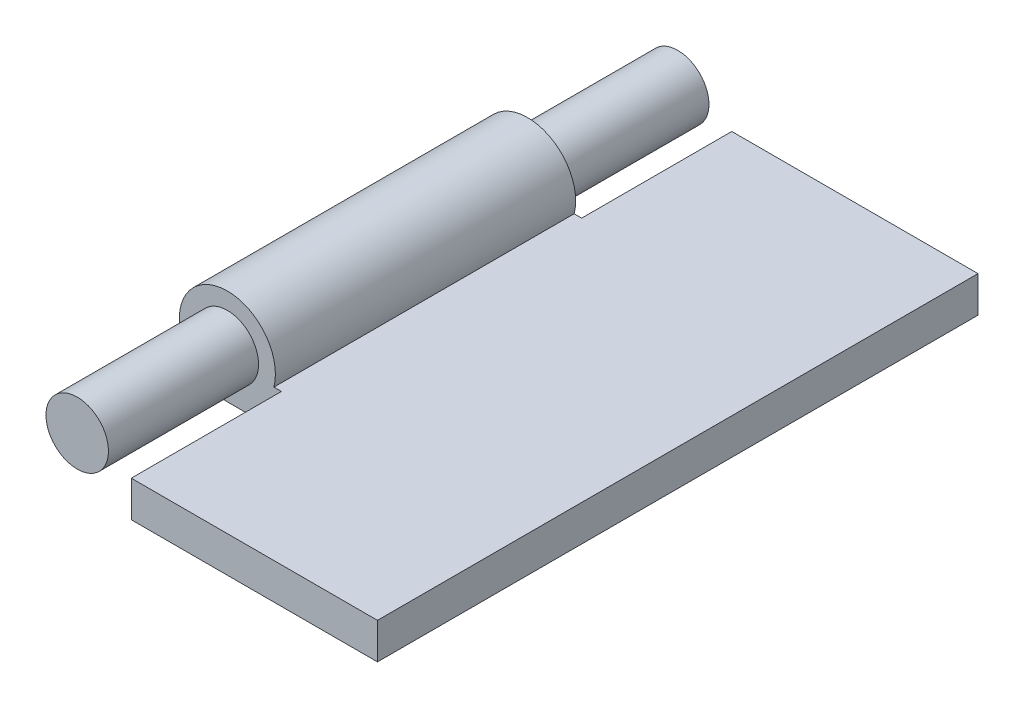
ISO-10303-21;
HEADER;
FILE_DESCRIPTION(('STEP AP214'),'2;1');
FILE_NAME('part.step','',(''),(''),'','','');
FILE_SCHEMA(('AUTOMOTIVE_DESIGN { 1 0 10303 214 1 1 1 1 }'));
ENDSEC;
DATA;
#1=APPLICATION_CONTEXT('core data for automotive mechanical design processes');
#2=APPLICATION_PROTOCOL_DEFINITION('international standard','automotive_design',2000,#1);
#3=PRODUCT_CONTEXT('',#1,'mechanical');
#4=PRODUCT('Part','Part','',(#3));
#5=PRODUCT_RELATED_PRODUCT_CATEGORY('part','',(#4));
#6=PRODUCT_DEFINITION_FORMATION('','',#4);
#7=PRODUCT_DEFINITION_CONTEXT('part definition',#1,'design');
#8=PRODUCT_DEFINITION('design','',#6,#7);
#9=PRODUCT_DEFINITION_SHAPE('','',#8);
#10=(LENGTH_UNIT() NAMED_UNIT(*) SI_UNIT(.MILLI.,.METRE.));
#11=(NAMED_UNIT(*) PLANE_ANGLE_UNIT() SI_UNIT($,.RADIAN.));
#12=(NAMED_UNIT(*) SI_UNIT($,.STERADIAN.) SOLID_ANGLE_UNIT());
#13=UNCERTAINTY_MEASURE_WITH_UNIT(LENGTH_MEASURE(1.E-05),#10,'distance_accuracy_value','');
#14=(GEOMETRIC_REPRESENTATION_CONTEXT(3) GLOBAL_UNCERTAINTY_ASSIGNED_CONTEXT((#13)) GLOBAL_UNIT_ASSIGNED_CONTEXT((#10,
#11,#12)) REPRESENTATION_CONTEXT('',''));
#15=CARTESIAN_POINT('',(0.,0.,0.));
#16=DIRECTION('',(0.,0.,1.));
#17=DIRECTION('',(1.,0.,0.));
#18=AXIS2_PLACEMENT_3D('',#15,#16,#17);
#19=CARTESIAN_POINT('',(12.5,-1.,25.));
#20=DIRECTION('',(0.,1.,0.));
#21=DIRECTION('',(1.,0.,0.));
#22=AXIS2_PLACEMENT_3D('',#19,#20,#21);
#23=PLANE('',#22);
#24=DIRECTION('',(0.,0.,-1.));
#25=VECTOR('',#24,1.);
#26=CARTESIAN_POINT('',(4.5,-1.,25.));
#27=LINE('',#26,#25);
#28=CARTESIAN_POINT('',(4.5,-1.,50.));
#29=VERTEX_POINT('',#28);
#30=CARTESIAN_POINT('',(4.5,-1.,37.5));
#31=VERTEX_POINT('',#30);
#32=EDGE_CURVE('E183',#29,#31,#27,.T.);
#33=ORIENTED_EDGE('',*,*,#32,.F.);
#34=DIRECTION('',(-1.,0.,0.));
#35=VECTOR('',#34,1.);
#36=CARTESIAN_POINT('',(12.5,-1.,50.));
#37=LINE('',#36,#35);
#38=CARTESIAN_POINT('',(25.,-1.,50.));
#39=VERTEX_POINT('',#38);
#40=EDGE_CURVE('E10',#39,#29,#37,.T.);
#41=ORIENTED_EDGE('',*,*,#40,.F.);
#42=DIRECTION('',(0.,0.,1.));
#43=VECTOR('',#42,1.);
#44=CARTESIAN_POINT('',(25.,-1.,25.));
#45=LINE('',#44,#43);
#46=CARTESIAN_POINT('',(25.,-1.,0.));
#47=VERTEX_POINT('',#46);
#48=EDGE_CURVE('E132',#47,#39,#45,.T.);
#49=ORIENTED_EDGE('',*,*,#48,.F.);
#50=DIRECTION('',(1.,0.,0.));
#51=VECTOR('',#50,1.);
#52=CARTESIAN_POINT('',(12.5,-1.,0.));
#53=LINE('',#52,#51);
#54=CARTESIAN_POINT('',(4.5,-1.,0.));
#55=VERTEX_POINT('',#54);
#56=EDGE_CURVE('E24',#55,#47,#53,.T.);
#57=ORIENTED_EDGE('',*,*,#56,.F.);
#58=DIRECTION('',(0.,0.,-1.));
#59=VECTOR('',#58,1.);
#60=CARTESIAN_POINT('',(4.5,-1.,25.));
#61=LINE('',#60,#59);
#62=CARTESIAN_POINT('',(4.5,-1.,12.5));
#63=VERTEX_POINT('',#62);
#64=EDGE_CURVE('E117',#63,#55,#61,.T.);
#65=ORIENTED_EDGE('',*,*,#64,.F.);
#66=DIRECTION('',(1.,0.,0.));
#67=VECTOR('',#66,1.);
#68=CARTESIAN_POINT('',(12.5,-1.,12.5));
#69=LINE('',#68,#67);
#70=CARTESIAN_POINT('',(3.87298334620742,-1.,12.5));
#71=VERTEX_POINT('',#70);
#72=EDGE_CURVE('E148',#71,#63,#69,.T.);
#73=ORIENTED_EDGE('',*,*,#72,.F.);
#74=DIRECTION('',(0.,0.,-1.));
#75=VECTOR('',#74,1.);
#76=CARTESIAN_POINT('',(3.87298334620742,-1.,50.));
#77=LINE('',#76,#75);
#78=CARTESIAN_POINT('',(3.87298334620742,-1.,37.5));
#79=VERTEX_POINT('',#78);
#80=EDGE_CURVE('E107',#79,#71,#77,.T.);
#81=ORIENTED_EDGE('',*,*,#80,.F.);
#82=DIRECTION('',(-1.,0.,0.));
#83=VECTOR('',#82,1.);
#84=CARTESIAN_POINT('',(12.5,-1.,37.5));
#85=LINE('',#84,#83);
#86=EDGE_CURVE('E188',#31,#79,#85,.T.);
#87=ORIENTED_EDGE('',*,*,#86,.F.);
#88=EDGE_LOOP('',(#33,#41,#49,#57,#65,#73,#81,#87));
#89=FACE_BOUND('',#88,.T.);
#90=ADVANCED_FACE('F15',(#89),#23,.T.);
#91=CARTESIAN_POINT('',(12.5,-4.,50.));
#92=DIRECTION('',(0.,0.,1.));
#93=DIRECTION('',(0.,-1.,0.));
#94=AXIS2_PLACEMENT_3D('',#91,#92,#93);
#95=PLANE('',#94);
#96=DIRECTION('',(0.,1.,0.));
#97=VECTOR('',#96,1.);
#98=CARTESIAN_POINT('',(4.5,0.,50.));
#99=LINE('',#98,#97);
#100=CARTESIAN_POINT('',(4.5,-4.,50.));
#101=VERTEX_POINT('',#100);
#102=EDGE_CURVE('E84',#101,#29,#99,.T.);
#103=ORIENTED_EDGE('',*,*,#102,.F.);
#104=DIRECTION('',(1.,0.,0.));
#105=VECTOR('',#104,1.);
#106=CARTESIAN_POINT('',(12.5,-4.,50.));
#107=LINE('',#106,#105);
#108=CARTESIAN_POINT('',(25.,-4.,50.));
#109=VERTEX_POINT('',#108);
#110=EDGE_CURVE('E95',#101,#109,#107,.T.);
#111=ORIENTED_EDGE('',*,*,#110,.T.);
#112=DIRECTION('',(0.,1.,0.));
#113=VECTOR('',#112,1.);
#114=CARTESIAN_POINT('',(25.,-4.,50.));
#115=LINE('',#114,#113);
#116=EDGE_CURVE('E123',#109,#39,#115,.T.);
#117=ORIENTED_EDGE('',*,*,#116,.T.);
#118=ORIENTED_EDGE('',*,*,#40,.T.);
#119=EDGE_LOOP('',(#103,#111,#117,#118));
#120=FACE_BOUND('',#119,.T.);
#121=ADVANCED_FACE('F93',(#120),#95,.T.);
#122=CARTESIAN_POINT('',(12.5,-4.,0.));
#123=DIRECTION('',(0.,0.,-1.));
#124=DIRECTION('',(0.,1.,0.));
#125=AXIS2_PLACEMENT_3D('',#122,#123,#124);
#126=PLANE('',#125);
#127=DIRECTION('',(0.,-1.,0.));
#128=VECTOR('',#127,1.);
#129=CARTESIAN_POINT('',(4.5,0.,0.));
#130=LINE('',#129,#128);
#131=CARTESIAN_POINT('',(4.5,-4.,0.));
#132=VERTEX_POINT('',#131);
#133=EDGE_CURVE('E140',#55,#132,#130,.T.);
#134=ORIENTED_EDGE('',*,*,#133,.F.);
#135=ORIENTED_EDGE('',*,*,#56,.T.);
#136=DIRECTION('',(0.,1.,0.));
#137=VECTOR('',#136,1.);
#138=CARTESIAN_POINT('',(25.,-4.,0.));
#139=LINE('',#138,#137);
#140=CARTESIAN_POINT('',(25.,-4.,0.));
#141=VERTEX_POINT('',#140);
#142=EDGE_CURVE('E128',#141,#47,#139,.T.);
#143=ORIENTED_EDGE('',*,*,#142,.F.);
#144=DIRECTION('',(-1.,0.,0.));
#145=VECTOR('',#144,1.);
#146=CARTESIAN_POINT('',(12.5,-4.,0.));
#147=LINE('',#146,#145);
#148=EDGE_CURVE('E114',#141,#132,#147,.T.);
#149=ORIENTED_EDGE('',*,*,#148,.T.);
#150=EDGE_LOOP('',(#134,#135,#143,#149));
#151=FACE_BOUND('',#150,.T.);
#152=ADVANCED_FACE('F170',(#151),#126,.T.);
#153=CARTESIAN_POINT('',(12.5,-4.,25.));
#154=DIRECTION('',(0.,-1.,0.));
#155=DIRECTION('',(-1.,0.,0.));
#156=AXIS2_PLACEMENT_3D('',#153,#154,#155);
#157=PLANE('',#156);
#158=DIRECTION('',(0.,0.,1.));
#159=VECTOR('',#158,1.);
#160=CARTESIAN_POINT('',(4.5,-4.,43.75));
#161=LINE('',#160,#159);
#162=CARTESIAN_POINT('',(4.5,-4.,37.5));
#163=VERTEX_POINT('',#162);
#164=EDGE_CURVE('E81',#163,#101,#161,.T.);
#165=ORIENTED_EDGE('',*,*,#164,.F.);
#166=DIRECTION('',(1.,0.,0.));
#167=VECTOR('',#166,1.);
#168=CARTESIAN_POINT('',(-4.,-4.,37.5));
#169=LINE('',#168,#167);
#170=CARTESIAN_POINT('',(0.,-4.,37.5));
#171=VERTEX_POINT('',#170);
#172=EDGE_CURVE('E98',#171,#163,#169,.T.);
#173=ORIENTED_EDGE('',*,*,#172,.F.);
#174=DIRECTION('',(0.,0.,1.));
#175=VECTOR('',#174,1.);
#176=CARTESIAN_POINT('',(0.,-4.,25.));
#177=LINE('',#176,#175);
#178=CARTESIAN_POINT('',(0.,-4.,12.5));
#179=VERTEX_POINT('',#178);
#180=EDGE_CURVE('E106',#179,#171,#177,.T.);
#181=ORIENTED_EDGE('',*,*,#180,.F.);
#182=DIRECTION('',(1.,0.,0.));
#183=VECTOR('',#182,1.);
#184=CARTESIAN_POINT('',(-4.,-4.,12.5));
#185=LINE('',#184,#183);
#186=CARTESIAN_POINT('',(4.5,-4.,12.5));
#187=VERTEX_POINT('',#186);
#188=EDGE_CURVE('E176',#179,#187,#185,.T.);
#189=ORIENTED_EDGE('',*,*,#188,.T.);
#190=DIRECTION('',(0.,0.,1.));
#191=VECTOR('',#190,1.);
#192=CARTESIAN_POINT('',(4.5,-4.,6.25));
#193=LINE('',#192,#191);
#194=EDGE_CURVE('E151',#132,#187,#193,.T.);
#195=ORIENTED_EDGE('',*,*,#194,.F.);
#196=ORIENTED_EDGE('',*,*,#148,.F.);
#197=DIRECTION('',(0.,0.,-1.));
#198=VECTOR('',#197,1.);
#199=CARTESIAN_POINT('',(25.,-4.,25.));
#200=LINE('',#199,#198);
#201=EDGE_CURVE('E104',#109,#141,#200,.T.);
#202=ORIENTED_EDGE('',*,*,#201,.F.);
#203=ORIENTED_EDGE('',*,*,#110,.F.);
#204=EDGE_LOOP('',(#165,#173,#181,#189,#195,#196,#202,#203));
#205=FACE_BOUND('',#204,.T.);
#206=ADVANCED_FACE('F101',(#205),#157,.T.);
#207=CARTESIAN_POINT('',(25.,-4.,25.));
#208=DIRECTION('',(1.,0.,0.));
#209=DIRECTION('',(0.,-1.,0.));
#210=AXIS2_PLACEMENT_3D('',#207,#208,#209);
#211=PLANE('',#210);
#212=ORIENTED_EDGE('',*,*,#201,.T.);
#213=ORIENTED_EDGE('',*,*,#142,.T.);
#214=ORIENTED_EDGE('',*,*,#48,.T.);
#215=ORIENTED_EDGE('',*,*,#116,.F.);
#216=EDGE_LOOP('',(#212,#213,#214,#215));
#217=FACE_BOUND('',#216,.T.);
#218=ADVANCED_FACE('F172',(#217),#211,.T.);
#219=CARTESIAN_POINT('',(0.,0.,50.));
#220=DIRECTION('',(0.,0.,-1.));
#221=DIRECTION('',(1.,0.,0.));
#222=AXIS2_PLACEMENT_3D('',#219,#220,#221);
#223=CYLINDRICAL_SURFACE('',#222,4.);
#224=CARTESIAN_POINT('',(0.,0.,37.5));
#225=DIRECTION('',(0.,0.,-1.));
#226=DIRECTION('',(-1.,0.,0.));
#227=AXIS2_PLACEMENT_3D('',#224,#225,#226);
#228=CIRCLE('',#227,4.);
#229=EDGE_CURVE('E191',#79,#171,#228,.F.);
#230=ORIENTED_EDGE('',*,*,#229,.F.);
#231=ORIENTED_EDGE('',*,*,#80,.T.);
#232=CARTESIAN_POINT('',(0.,0.,12.5));
#233=DIRECTION('',(0.,0.,1.));
#234=DIRECTION('',(1.,0.,0.));
#235=AXIS2_PLACEMENT_3D('',#232,#233,#234);
#236=CIRCLE('',#235,4.);
#237=EDGE_CURVE('E139',#179,#71,#236,.F.);
#238=ORIENTED_EDGE('',*,*,#237,.F.);
#239=ORIENTED_EDGE('',*,*,#180,.T.);
#240=EDGE_LOOP('',(#230,#231,#238,#239));
#241=FACE_BOUND('',#240,.T.);
#242=ADVANCED_FACE('F233',(#241),#223,.T.);
#243=CARTESIAN_POINT('',(-4.,0.,12.5));
#244=DIRECTION('',(0.,0.,1.));
#245=DIRECTION('',(1.,0.,0.));
#246=AXIS2_PLACEMENT_3D('',#243,#244,#245);
#247=PLANE('',#246);
#248=ORIENTED_EDGE('',*,*,#72,.T.);
#249=DIRECTION('',(0.,1.,0.));
#250=VECTOR('',#249,1.);
#251=CARTESIAN_POINT('',(4.5,0.,12.5));
#252=LINE('',#251,#250);
#253=EDGE_CURVE('E158',#187,#63,#252,.T.);
#254=ORIENTED_EDGE('',*,*,#253,.F.);
#255=ORIENTED_EDGE('',*,*,#188,.F.);
#256=ORIENTED_EDGE('',*,*,#237,.T.);
#257=EDGE_LOOP('',(#248,#254,#255,#256));
#258=FACE_BOUND('',#257,.T.);
#259=CARTESIAN_POINT('',(0.,0.,12.5));
#260=DIRECTION('',(0.,0.,1.));
#261=DIRECTION('',(1.,0.,0.));
#262=AXIS2_PLACEMENT_3D('',#259,#260,#261);
#263=CIRCLE('',#262,2.6);
#264=CARTESIAN_POINT('',(2.6,0.,12.5));
#265=VERTEX_POINT('',#264);
#266=EDGE_CURVE('E136',#265,#265,#263,.F.);
#267=ORIENTED_EDGE('',*,*,#266,.F.);
#268=EDGE_LOOP('',(#267));
#269=FACE_BOUND('',#268,.T.);
#270=ADVANCED_FACE('F178',(#258,#269),#247,.F.);
#271=CARTESIAN_POINT('',(4.5,0.,6.25));
#272=DIRECTION('',(1.,0.,0.));
#273=DIRECTION('',(0.,1.,0.));
#274=AXIS2_PLACEMENT_3D('',#271,#272,#273);
#275=PLANE('',#274);
#276=ORIENTED_EDGE('',*,*,#64,.T.);
#277=ORIENTED_EDGE('',*,*,#133,.T.);
#278=ORIENTED_EDGE('',*,*,#194,.T.);
#279=ORIENTED_EDGE('',*,*,#253,.T.);
#280=EDGE_LOOP('',(#276,#277,#278,#279));
#281=FACE_BOUND('',#280,.T.);
#282=ADVANCED_FACE('F167',(#281),#275,.F.);
#283=CARTESIAN_POINT('',(-4.,0.,37.5));
#284=DIRECTION('',(0.,0.,-1.));
#285=DIRECTION('',(-1.,0.,0.));
#286=AXIS2_PLACEMENT_3D('',#283,#284,#285);
#287=PLANE('',#286);
#288=ORIENTED_EDGE('',*,*,#86,.T.);
#289=ORIENTED_EDGE('',*,*,#229,.T.);
#290=ORIENTED_EDGE('',*,*,#172,.T.);
#291=DIRECTION('',(0.,-1.,0.));
#292=VECTOR('',#291,1.);
#293=CARTESIAN_POINT('',(4.5,0.,37.5));
#294=LINE('',#293,#292);
#295=EDGE_CURVE('E86',#31,#163,#294,.T.);
#296=ORIENTED_EDGE('',*,*,#295,.F.);
#297=EDGE_LOOP('',(#288,#289,#290,#296));
#298=FACE_BOUND('',#297,.T.);
#299=CARTESIAN_POINT('',(0.,0.,37.5));
#300=DIRECTION('',(0.,0.,-1.));
#301=DIRECTION('',(-1.,0.,0.));
#302=AXIS2_PLACEMENT_3D('',#299,#300,#301);
#303=CIRCLE('',#302,2.6);
#304=CARTESIAN_POINT('',(-2.6,0.,37.5));
#305=VERTEX_POINT('',#304);
#306=EDGE_CURVE('E18',#305,#305,#303,.F.);
#307=ORIENTED_EDGE('',*,*,#306,.F.);
#308=EDGE_LOOP('',(#307));
#309=FACE_BOUND('',#308,.T.);
#310=ADVANCED_FACE('F241',(#298,#309),#287,.F.);
#311=CARTESIAN_POINT('',(4.5,0.,43.75));
#312=DIRECTION('',(1.,0.,0.));
#313=DIRECTION('',(0.,1.,0.));
#314=AXIS2_PLACEMENT_3D('',#311,#312,#313);
#315=PLANE('',#314);
#316=ORIENTED_EDGE('',*,*,#32,.T.);
#317=ORIENTED_EDGE('',*,*,#295,.T.);
#318=ORIENTED_EDGE('',*,*,#164,.T.);
#319=ORIENTED_EDGE('',*,*,#102,.T.);
#320=EDGE_LOOP('',(#316,#317,#318,#319));
#321=FACE_BOUND('',#320,.T.);
#322=ADVANCED_FACE('F83',(#321),#315,.F.);
#323=CARTESIAN_POINT('',(0.,0.,50.));
#324=DIRECTION('',(0.,0.,1.));
#325=DIRECTION('',(1.,0.,0.));
#326=AXIS2_PLACEMENT_3D('',#323,#324,#325);
#327=PLANE('',#326);
#328=CARTESIAN_POINT('',(0.,0.,50.));
#329=DIRECTION('',(0.,0.,-1.));
#330=DIRECTION('',(0.,1.,0.));
#331=AXIS2_PLACEMENT_3D('',#328,#329,#330);
#332=CIRCLE('',#331,2.6);
#333=CARTESIAN_POINT('',(0.,2.6,50.));
#334=VERTEX_POINT('',#333);
#335=EDGE_CURVE('E198',#334,#334,#332,.T.);
#336=ORIENTED_EDGE('',*,*,#335,.F.);
#337=EDGE_LOOP('',(#336));
#338=FACE_BOUND('',#337,.T.);
#339=ADVANCED_FACE('F246',(#338),#327,.T.);
#340=CARTESIAN_POINT('',(0.,0.,0.));
#341=DIRECTION('',(0.,0.,1.));
#342=DIRECTION('',(0.,1.,0.));
#343=AXIS2_PLACEMENT_3D('',#340,#341,#342);
#344=CYLINDRICAL_SURFACE('',#343,2.6);
#345=ORIENTED_EDGE('',*,*,#335,.T.);
#346=EDGE_LOOP('',(#345));
#347=FACE_BOUND('',#346,.T.);
#348=ORIENTED_EDGE('',*,*,#306,.T.);
#349=EDGE_LOOP('',(#348));
#350=FACE_BOUND('',#349,.T.);
#351=ADVANCED_FACE('F219',(#347,#350),#344,.T.);
#352=CARTESIAN_POINT('',(0.,0.,0.));
#353=DIRECTION('',(0.,0.,1.));
#354=DIRECTION('',(0.,1.,0.));
#355=AXIS2_PLACEMENT_3D('',#352,#353,#354);
#356=CIRCLE('',#355,2.6);
#357=CARTESIAN_POINT('',(0.,2.6,0.));
#358=VERTEX_POINT('',#357);
#359=EDGE_CURVE('E202',#358,#358,#356,.T.);
#360=ORIENTED_EDGE('',*,*,#359,.T.);
#361=EDGE_LOOP('',(#360));
#362=FACE_BOUND('',#361,.T.);
#363=ORIENTED_EDGE('',*,*,#266,.T.);
#364=EDGE_LOOP('',(#363));
#365=FACE_BOUND('',#364,.T.);
#366=ADVANCED_FACE('F210',(#362,#365),#344,.T.);
#367=CARTESIAN_POINT('',(0.,0.,0.));
#368=DIRECTION('',(0.,0.,-1.));
#369=DIRECTION('',(-1.,0.,0.));
#370=AXIS2_PLACEMENT_3D('',#367,#368,#369);
#371=PLANE('',#370);
#372=ORIENTED_EDGE('',*,*,#359,.F.);
#373=EDGE_LOOP('',(#372));
#374=FACE_BOUND('',#373,.T.);
#375=ADVANCED_FACE('F212',(#374),#371,.T.);
#376=CLOSED_SHELL('',(#90,#121,#152,#206,#218,#242,#270,#282,#310,#322,#339,#351,#366,#375));
#377=MANIFOLD_SOLID_BREP('B1',#376);
#378=ADVANCED_BREP_SHAPE_REPRESENTATION('',(#18,#377),#14);
#379=SHAPE_DEFINITION_REPRESENTATION(#9,#378);
ENDSEC;
END-ISO-10303-21;
